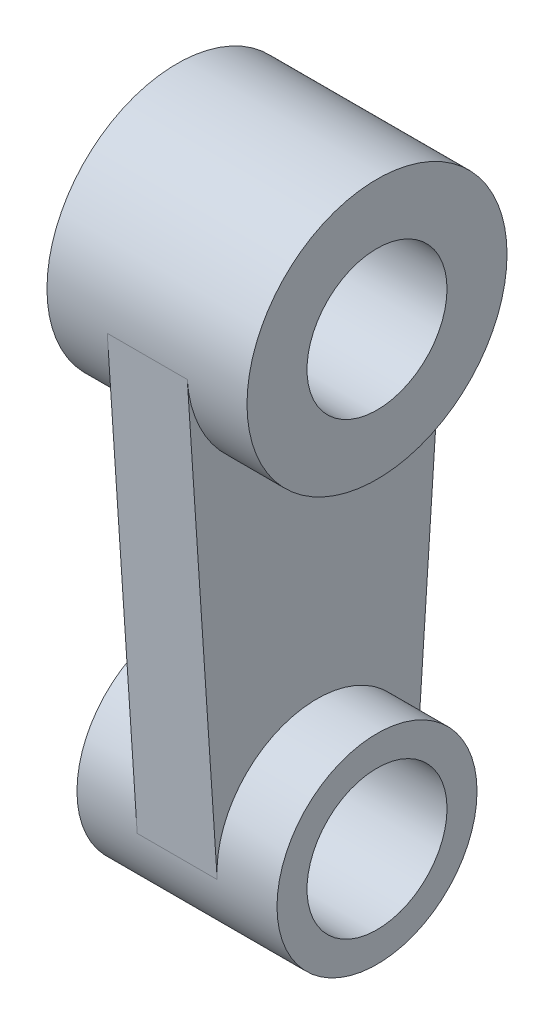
from build123d import *

# Parameters (mm, degrees)
BOSS_EXTRUDE1_DEPTH = 10
SKETCH1_5_R         = 32.5
SKETCH1_5_R_2       = 17.5
SKETCH1_5_R_3       = 25
BOSS_EXTRUDE4_DEPTH = 25


with BuildPart() as part:
    # Sketch1 → Boss-Extrude1 (new, symmetric)
    with BuildSketch(Plane(origin=(0, 0, 0), x_dir=(0, 0, -1), z_dir=(1, 0, 0))):
        with BuildLine():
            Line((0, -32.5), (0, -87.5))
            ThreePointArc((0, -87.5), (17.67766953, -94.82233047), (25, -112.5))
            ThreePointArc((25, -112.5), (24.986091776, -113.333797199), (24.944382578, -114.166666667))
            Line((24.944382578, -114.166666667), (32.427697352, -2.166666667))
            ThreePointArc((32.427697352, -2.166666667), (22.20172666, -23.734644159), (0, -32.5))
        make_face()
        with BuildLine():
            ThreePointArc((-24.944382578, -114.166666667), (-18.257418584, -95.421748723), (0, -87.5))
            Line((0, -87.5), (0, -32.5))
            ThreePointArc((0, -32.5), (-22.20172666, -23.734644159), (-32.427697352, -2.166666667))
            Line((-32.427697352, -2.166666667), (-24.944382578, -114.166666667))
        make_face()
    extrude(amount=BOSS_EXTRUDE1_DEPTH, both=True)

    # Sketch1_5 → Boss-Extrude4 (add, symmetric)
    # profile 1 of 2: a face of its own
    with BuildSketch(Plane(origin=(0, 0, 0), x_dir=(0, 0, -1), z_dir=(1, 0, 0))):
        Circle(SKETCH1_5_R)
        Circle(SKETCH1_5_R_2, mode=Mode.SUBTRACT)
    # profile 2 of 2: a face of its own
    with BuildSketch(Plane(origin=(0, 0, 0), x_dir=(0, 0, -1), z_dir=(1, 0, 0))):
        with Locations((0, -112.5)):
            Circle(SKETCH1_5_R_3)
        with Locations((0, -112.5)):
            Circle(SKETCH1_5_R_2, mode=Mode.SUBTRACT)
    extrude(amount=BOSS_EXTRUDE4_DEPTH, both=True)


solid = part.part
